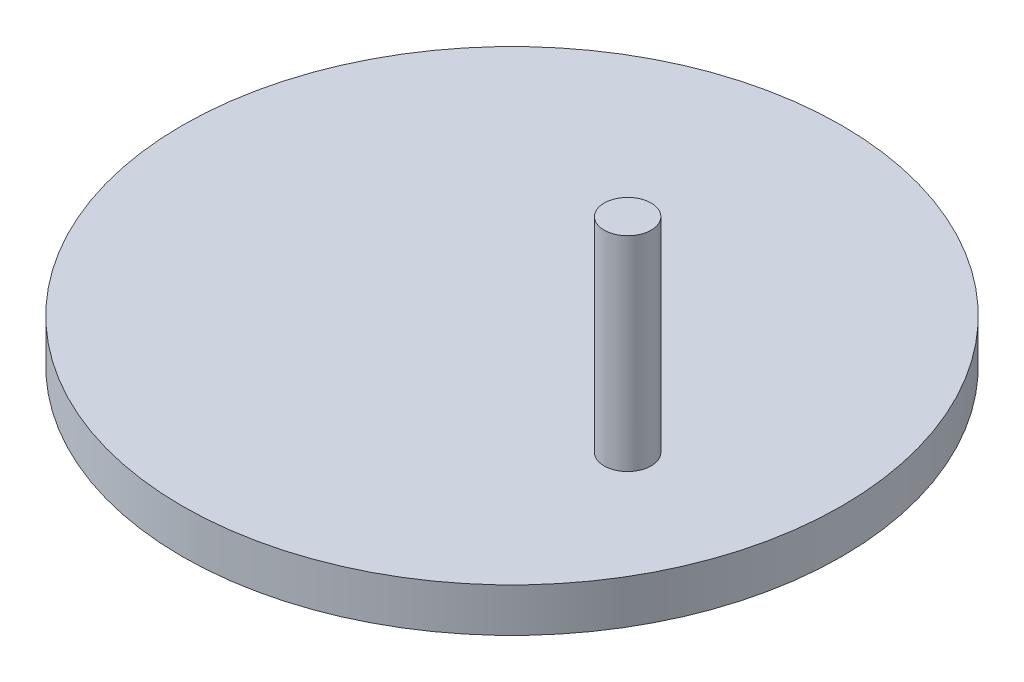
ISO-10303-21;
HEADER;
FILE_DESCRIPTION(('STEP AP214'),'2;1');
FILE_NAME('part.step','',(''),(''),'','','');
FILE_SCHEMA(('AUTOMOTIVE_DESIGN { 1 0 10303 214 1 1 1 1 }'));
ENDSEC;
DATA;
#1=APPLICATION_CONTEXT('core data for automotive mechanical design processes');
#2=APPLICATION_PROTOCOL_DEFINITION('international standard','automotive_design',2000,#1);
#3=PRODUCT_CONTEXT('',#1,'mechanical');
#4=PRODUCT('Part','Part','',(#3));
#5=PRODUCT_RELATED_PRODUCT_CATEGORY('part','',(#4));
#6=PRODUCT_DEFINITION_FORMATION('','',#4);
#7=PRODUCT_DEFINITION_CONTEXT('part definition',#1,'design');
#8=PRODUCT_DEFINITION('design','',#6,#7);
#9=PRODUCT_DEFINITION_SHAPE('','',#8);
#10=(LENGTH_UNIT() NAMED_UNIT(*) SI_UNIT(.MILLI.,.METRE.));
#11=(NAMED_UNIT(*) PLANE_ANGLE_UNIT() SI_UNIT($,.RADIAN.));
#12=(NAMED_UNIT(*) SI_UNIT($,.STERADIAN.) SOLID_ANGLE_UNIT());
#13=UNCERTAINTY_MEASURE_WITH_UNIT(LENGTH_MEASURE(1.E-05),#10,'distance_accuracy_value','');
#14=(GEOMETRIC_REPRESENTATION_CONTEXT(3) GLOBAL_UNCERTAINTY_ASSIGNED_CONTEXT((#13)) GLOBAL_UNIT_ASSIGNED_CONTEXT((#10,
#11,#12)) REPRESENTATION_CONTEXT('',''));
#15=CARTESIAN_POINT('',(0.,0.,0.));
#16=DIRECTION('',(0.,0.,1.));
#17=DIRECTION('',(1.,0.,0.));
#18=AXIS2_PLACEMENT_3D('',#15,#16,#17);
#19=CARTESIAN_POINT('',(0.,15.,0.));
#20=DIRECTION('',(0.,-1.,0.));
#21=DIRECTION('',(0.,0.,-1.));
#22=AXIS2_PLACEMENT_3D('',#19,#20,#21);
#23=CYLINDRICAL_SURFACE('',#22,113.);
#24=CARTESIAN_POINT('',(0.,15.,0.));
#25=DIRECTION('',(0.,1.,0.));
#26=DIRECTION('',(1.,0.,0.));
#27=AXIS2_PLACEMENT_3D('',#24,#25,#26);
#28=CIRCLE('',#27,113.);
#29=CARTESIAN_POINT('',(113.,15.,0.));
#30=VERTEX_POINT('',#29);
#31=EDGE_CURVE('E20',#30,#30,#28,.T.);
#32=ORIENTED_EDGE('',*,*,#31,.F.);
#33=EDGE_LOOP('',(#32));
#34=FACE_BOUND('',#33,.T.);
#35=CARTESIAN_POINT('',(0.,0.,0.));
#36=DIRECTION('',(0.,1.,0.));
#37=DIRECTION('',(1.,0.,0.));
#38=AXIS2_PLACEMENT_3D('',#35,#36,#37);
#39=CIRCLE('',#38,113.);
#40=CARTESIAN_POINT('',(113.,0.,0.));
#41=VERTEX_POINT('',#40);
#42=EDGE_CURVE('E27',#41,#41,#39,.T.);
#43=ORIENTED_EDGE('',*,*,#42,.T.);
#44=EDGE_LOOP('',(#43));
#45=FACE_BOUND('',#44,.T.);
#46=ADVANCED_FACE('F13',(#34,#45),#23,.T.);
#47=CARTESIAN_POINT('',(0.,15.,0.));
#48=DIRECTION('',(0.,1.,0.));
#49=DIRECTION('',(0.,0.,1.));
#50=AXIS2_PLACEMENT_3D('',#47,#48,#49);
#51=PLANE('',#50);
#52=CARTESIAN_POINT('',(60.388214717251,15.,20.7487712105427));
#53=DIRECTION('',(0.,1.,0.));
#54=DIRECTION('',(0.,0.,1.));
#55=AXIS2_PLACEMENT_3D('',#52,#53,#54);
#56=CIRCLE('',#55,8.05176196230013);
#57=CARTESIAN_POINT('',(60.388214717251,15.,28.8005331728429));
#58=VERTEX_POINT('',#57);
#59=EDGE_CURVE('E8',#58,#58,#56,.T.);
#60=ORIENTED_EDGE('',*,*,#59,.F.);
#61=EDGE_LOOP('',(#60));
#62=FACE_BOUND('',#61,.T.);
#63=ORIENTED_EDGE('',*,*,#31,.T.);
#64=EDGE_LOOP('',(#63));
#65=FACE_BOUND('',#64,.T.);
#66=ADVANCED_FACE('F49',(#62,#65),#51,.T.);
#67=CARTESIAN_POINT('',(0.,0.,0.));
#68=DIRECTION('',(0.,1.,0.));
#69=DIRECTION('',(0.,0.,1.));
#70=AXIS2_PLACEMENT_3D('',#67,#68,#69);
#71=PLANE('',#70);
#72=ORIENTED_EDGE('',*,*,#42,.F.);
#73=EDGE_LOOP('',(#72));
#74=FACE_BOUND('',#73,.T.);
#75=ADVANCED_FACE('F46',(#74),#71,.F.);
#76=CARTESIAN_POINT('',(60.388214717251,85.,20.7487712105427));
#77=DIRECTION('',(0.,-1.,0.));
#78=DIRECTION('',(0.,0.,-1.));
#79=AXIS2_PLACEMENT_3D('',#76,#77,#78);
#80=CYLINDRICAL_SURFACE('',#79,8.05176196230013);
#81=CARTESIAN_POINT('',(60.388214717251,85.,20.7487712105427));
#82=DIRECTION('',(0.,-1.,0.));
#83=DIRECTION('',(-1.,0.,0.));
#84=AXIS2_PLACEMENT_3D('',#81,#82,#83);
#85=CIRCLE('',#84,8.05176196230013);
#86=CARTESIAN_POINT('',(52.3364527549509,85.,20.7487712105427));
#87=VERTEX_POINT('',#86);
#88=EDGE_CURVE('E32',#87,#87,#85,.T.);
#89=ORIENTED_EDGE('',*,*,#88,.T.);
#90=EDGE_LOOP('',(#89));
#91=FACE_BOUND('',#90,.T.);
#92=ORIENTED_EDGE('',*,*,#59,.T.);
#93=EDGE_LOOP('',(#92));
#94=FACE_BOUND('',#93,.T.);
#95=ADVANCED_FACE('F37',(#91,#94),#80,.T.);
#96=CARTESIAN_POINT('',(60.388214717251,85.,20.7487712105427));
#97=DIRECTION('',(0.,-1.,0.));
#98=DIRECTION('',(0.,0.,-1.));
#99=AXIS2_PLACEMENT_3D('',#96,#97,#98);
#100=PLANE('',#99);
#101=ORIENTED_EDGE('',*,*,#88,.F.);
#102=EDGE_LOOP('',(#101));
#103=FACE_BOUND('',#102,.T.);
#104=ADVANCED_FACE('F39',(#103),#100,.F.);
#105=CLOSED_SHELL('',(#46,#66,#75,#95,#104));
#106=MANIFOLD_SOLID_BREP('B1',#105);
#107=ADVANCED_BREP_SHAPE_REPRESENTATION('',(#18,#106),#14);
#108=SHAPE_DEFINITION_REPRESENTATION(#9,#107);
ENDSEC;
END-ISO-10303-21;
